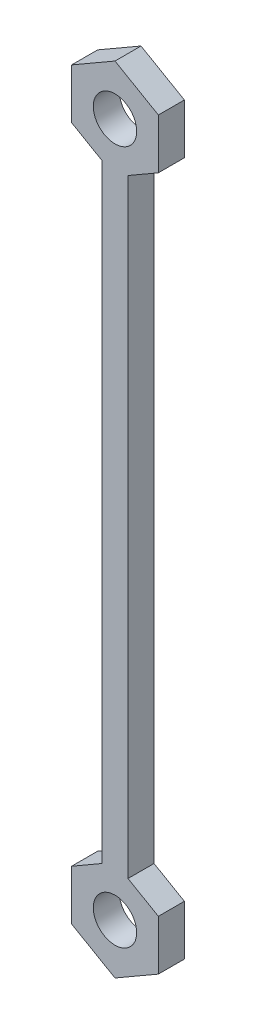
ISO-10303-21;
HEADER;
FILE_DESCRIPTION(('STEP AP214'),'2;1');
FILE_NAME('part.step','',(''),(''),'','','');
FILE_SCHEMA(('AUTOMOTIVE_DESIGN { 1 0 10303 214 1 1 1 1 }'));
ENDSEC;
DATA;
#1=APPLICATION_CONTEXT('core data for automotive mechanical design processes');
#2=APPLICATION_PROTOCOL_DEFINITION('international standard','automotive_design',2000,#1);
#3=PRODUCT_CONTEXT('',#1,'mechanical');
#4=PRODUCT('Part','Part','',(#3));
#5=PRODUCT_RELATED_PRODUCT_CATEGORY('part','',(#4));
#6=PRODUCT_DEFINITION_FORMATION('','',#4);
#7=PRODUCT_DEFINITION_CONTEXT('part definition',#1,'design');
#8=PRODUCT_DEFINITION('design','',#6,#7);
#9=PRODUCT_DEFINITION_SHAPE('','',#8);
#10=(LENGTH_UNIT() NAMED_UNIT(*) SI_UNIT(.MILLI.,.METRE.));
#11=(NAMED_UNIT(*) PLANE_ANGLE_UNIT() SI_UNIT($,.RADIAN.));
#12=(NAMED_UNIT(*) SI_UNIT($,.STERADIAN.) SOLID_ANGLE_UNIT());
#13=UNCERTAINTY_MEASURE_WITH_UNIT(LENGTH_MEASURE(1.E-05),#10,'distance_accuracy_value','');
#14=(GEOMETRIC_REPRESENTATION_CONTEXT(3) GLOBAL_UNCERTAINTY_ASSIGNED_CONTEXT((#13)) GLOBAL_UNIT_ASSIGNED_CONTEXT((#10,
#11,#12)) REPRESENTATION_CONTEXT('',''));
#15=CARTESIAN_POINT('',(0.,0.,0.));
#16=DIRECTION('',(0.,0.,1.));
#17=DIRECTION('',(1.,0.,0.));
#18=AXIS2_PLACEMENT_3D('',#15,#16,#17);
#19=CARTESIAN_POINT('',(1.5,0.,1.5));
#20=DIRECTION('',(1.,0.,0.));
#21=DIRECTION('',(0.,0.,-1.));
#22=AXIS2_PLACEMENT_3D('',#19,#20,#21);
#23=PLANE('',#22);
#24=DIRECTION('',(0.,-1.,0.));
#25=VECTOR('',#24,1.);
#26=CARTESIAN_POINT('',(1.5,0.,-1.5));
#27=LINE('',#26,#25);
#28=CARTESIAN_POINT('',(1.5,35.0925227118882,-1.5));
#29=VERTEX_POINT('',#28);
#30=CARTESIAN_POINT('',(1.5,-35.0925227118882,-1.5));
#31=VERTEX_POINT('',#30);
#32=EDGE_CURVE('E176',#29,#31,#27,.T.);
#33=ORIENTED_EDGE('',*,*,#32,.F.);
#34=DIRECTION('',(0.,0.,-1.));
#35=VECTOR('',#34,1.);
#36=CARTESIAN_POINT('',(1.5,35.0925227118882,1.5));
#37=LINE('',#36,#35);
#38=CARTESIAN_POINT('',(1.5,35.0925227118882,1.5));
#39=VERTEX_POINT('',#38);
#40=EDGE_CURVE('E11',#39,#29,#37,.T.);
#41=ORIENTED_EDGE('',*,*,#40,.F.);
#42=DIRECTION('',(0.,-1.,0.));
#43=VECTOR('',#42,1.);
#44=CARTESIAN_POINT('',(1.5,0.,1.5));
#45=LINE('',#44,#43);
#46=CARTESIAN_POINT('',(1.5,-35.0925227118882,1.5));
#47=VERTEX_POINT('',#46);
#48=EDGE_CURVE('E254',#39,#47,#45,.T.);
#49=ORIENTED_EDGE('',*,*,#48,.T.);
#50=DIRECTION('',(0.,0.,-1.));
#51=VECTOR('',#50,1.);
#52=CARTESIAN_POINT('',(1.5,-35.0925227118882,1.5));
#53=LINE('',#52,#51);
#54=EDGE_CURVE('E109',#47,#31,#53,.T.);
#55=ORIENTED_EDGE('',*,*,#54,.T.);
#56=EDGE_LOOP('',(#33,#41,#49,#55));
#57=FACE_BOUND('',#56,.T.);
#58=ADVANCED_FACE('F40',(#57),#23,.T.);
#59=CARTESIAN_POINT('',(-14.8205080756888,25.6698729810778,1.5));
#60=DIRECTION('',(0.499999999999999,-0.866025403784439,0.));
#61=DIRECTION('',(0.866025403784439,0.499999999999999,0.));
#62=AXIS2_PLACEMENT_3D('',#59,#60,#61);
#63=PLANE('',#62);
#64=DIRECTION('',(-0.866025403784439,-0.499999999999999,0.));
#65=VECTOR('',#64,1.);
#66=CARTESIAN_POINT('',(-14.8205080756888,25.6698729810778,-1.5));
#67=LINE('',#66,#65);
#68=CARTESIAN_POINT('',(5.,37.1132486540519,-1.5));
#69=VERTEX_POINT('',#68);
#70=EDGE_CURVE('E179',#69,#29,#67,.T.);
#71=ORIENTED_EDGE('',*,*,#70,.F.);
#72=DIRECTION('',(0.,0.,-1.));
#73=VECTOR('',#72,1.);
#74=CARTESIAN_POINT('',(5.,37.1132486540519,1.5));
#75=LINE('',#74,#73);
#76=CARTESIAN_POINT('',(5.,37.1132486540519,1.5));
#77=VERTEX_POINT('',#76);
#78=EDGE_CURVE('E49',#77,#69,#75,.T.);
#79=ORIENTED_EDGE('',*,*,#78,.F.);
#80=DIRECTION('',(-0.866025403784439,-0.499999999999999,0.));
#81=VECTOR('',#80,1.);
#82=CARTESIAN_POINT('',(-14.8205080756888,25.6698729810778,1.5));
#83=LINE('',#82,#81);
#84=EDGE_CURVE('E252',#77,#39,#83,.T.);
#85=ORIENTED_EDGE('',*,*,#84,.T.);
#86=ORIENTED_EDGE('',*,*,#40,.T.);
#87=EDGE_LOOP('',(#71,#79,#85,#86));
#88=FACE_BOUND('',#87,.T.);
#89=ADVANCED_FACE('F251',(#88),#63,.T.);
#90=CARTESIAN_POINT('',(4.99999999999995,0.,1.5));
#91=DIRECTION('',(-1.,0.,0.));
#92=DIRECTION('',(0.,-1.,0.));
#93=AXIS2_PLACEMENT_3D('',#90,#91,#92);
#94=PLANE('',#93);
#95=DIRECTION('',(0.,1.,0.));
#96=VECTOR('',#95,1.);
#97=CARTESIAN_POINT('',(4.99999999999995,0.,-1.5));
#98=LINE('',#97,#96);
#99=CARTESIAN_POINT('',(5.00000000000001,42.8867513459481,-1.5));
#100=VERTEX_POINT('',#99);
#101=EDGE_CURVE('E182',#69,#100,#98,.T.);
#102=ORIENTED_EDGE('',*,*,#101,.T.);
#103=DIRECTION('',(0.,0.,-1.));
#104=VECTOR('',#103,1.);
#105=CARTESIAN_POINT('',(5.00000000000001,42.8867513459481,1.5));
#106=LINE('',#105,#104);
#107=CARTESIAN_POINT('',(5.00000000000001,42.8867513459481,1.5));
#108=VERTEX_POINT('',#107);
#109=EDGE_CURVE('E236',#108,#100,#106,.T.);
#110=ORIENTED_EDGE('',*,*,#109,.F.);
#111=DIRECTION('',(0.,1.,0.));
#112=VECTOR('',#111,1.);
#113=CARTESIAN_POINT('',(4.99999999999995,0.,1.5));
#114=LINE('',#113,#112);
#115=EDGE_CURVE('E244',#77,#108,#114,.T.);
#116=ORIENTED_EDGE('',*,*,#115,.F.);
#117=ORIENTED_EDGE('',*,*,#78,.T.);
#118=EDGE_LOOP('',(#102,#110,#116,#117));
#119=FACE_BOUND('',#118,.T.);
#120=ADVANCED_FACE('F241',(#119),#94,.F.);
#121=CARTESIAN_POINT('',(19.8205080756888,34.3301270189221,1.5));
#122=DIRECTION('',(-0.500000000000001,-0.866025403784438,0.));
#123=DIRECTION('',(0.866025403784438,-0.500000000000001,0.));
#124=AXIS2_PLACEMENT_3D('',#121,#122,#123);
#125=PLANE('',#124);
#126=DIRECTION('',(-0.866025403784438,0.500000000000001,0.));
#127=VECTOR('',#126,1.);
#128=CARTESIAN_POINT('',(19.8205080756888,34.3301270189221,-1.5));
#129=LINE('',#128,#127);
#130=CARTESIAN_POINT('',(0.,45.7735026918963,-1.5));
#131=VERTEX_POINT('',#130);
#132=EDGE_CURVE('E185',#100,#131,#129,.T.);
#133=ORIENTED_EDGE('',*,*,#132,.T.);
#134=DIRECTION('',(0.,0.,-1.));
#135=VECTOR('',#134,1.);
#136=CARTESIAN_POINT('',(0.,45.7735026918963,1.5));
#137=LINE('',#136,#135);
#138=CARTESIAN_POINT('',(0.,45.7735026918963,1.5));
#139=VERTEX_POINT('',#138);
#140=EDGE_CURVE('E233',#139,#131,#137,.T.);
#141=ORIENTED_EDGE('',*,*,#140,.F.);
#142=DIRECTION('',(-0.866025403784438,0.500000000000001,0.));
#143=VECTOR('',#142,1.);
#144=CARTESIAN_POINT('',(19.8205080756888,34.3301270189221,1.5));
#145=LINE('',#144,#143);
#146=EDGE_CURVE('E263',#108,#139,#145,.T.);
#147=ORIENTED_EDGE('',*,*,#146,.F.);
#148=ORIENTED_EDGE('',*,*,#109,.T.);
#149=EDGE_LOOP('',(#133,#141,#147,#148));
#150=FACE_BOUND('',#149,.T.);
#151=ADVANCED_FACE('F306',(#150),#125,.F.);
#152=CARTESIAN_POINT('',(-19.8205080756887,34.3301270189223,1.5));
#153=DIRECTION('',(0.499999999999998,-0.86602540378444,0.));
#154=DIRECTION('',(0.86602540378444,0.499999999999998,0.));
#155=AXIS2_PLACEMENT_3D('',#152,#153,#154);
#156=PLANE('',#155);
#157=DIRECTION('',(-0.86602540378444,-0.499999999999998,0.));
#158=VECTOR('',#157,1.);
#159=CARTESIAN_POINT('',(-19.8205080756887,34.3301270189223,-1.5));
#160=LINE('',#159,#158);
#161=CARTESIAN_POINT('',(-4.99999999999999,42.8867513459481,-1.5));
#162=VERTEX_POINT('',#161);
#163=EDGE_CURVE('E188',#131,#162,#160,.T.);
#164=ORIENTED_EDGE('',*,*,#163,.T.);
#165=DIRECTION('',(0.,0.,-1.));
#166=VECTOR('',#165,1.);
#167=CARTESIAN_POINT('',(-4.99999999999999,42.8867513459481,1.5));
#168=LINE('',#167,#166);
#169=CARTESIAN_POINT('',(-4.99999999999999,42.8867513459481,1.5));
#170=VERTEX_POINT('',#169);
#171=EDGE_CURVE('E230',#170,#162,#168,.T.);
#172=ORIENTED_EDGE('',*,*,#171,.F.);
#173=DIRECTION('',(-0.86602540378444,-0.499999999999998,0.));
#174=VECTOR('',#173,1.);
#175=CARTESIAN_POINT('',(-19.8205080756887,34.3301270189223,1.5));
#176=LINE('',#175,#174);
#177=EDGE_CURVE('E266',#139,#170,#176,.T.);
#178=ORIENTED_EDGE('',*,*,#177,.F.);
#179=ORIENTED_EDGE('',*,*,#140,.T.);
#180=EDGE_LOOP('',(#164,#172,#178,#179));
#181=FACE_BOUND('',#180,.T.);
#182=ADVANCED_FACE('F303',(#181),#156,.F.);
#183=CARTESIAN_POINT('',(-5.00000000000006,0.,1.5));
#184=DIRECTION('',(1.,0.,0.));
#185=DIRECTION('',(0.,1.,0.));
#186=AXIS2_PLACEMENT_3D('',#183,#184,#185);
#187=PLANE('',#186);
#188=DIRECTION('',(0.,-1.,0.));
#189=VECTOR('',#188,1.);
#190=CARTESIAN_POINT('',(-5.00000000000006,0.,-1.5));
#191=LINE('',#190,#189);
#192=CARTESIAN_POINT('',(-5.,37.1132486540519,-1.5));
#193=VERTEX_POINT('',#192);
#194=EDGE_CURVE('E191',#162,#193,#191,.T.);
#195=ORIENTED_EDGE('',*,*,#194,.T.);
#196=DIRECTION('',(0.,0.,-1.));
#197=VECTOR('',#196,1.);
#198=CARTESIAN_POINT('',(-5.,37.1132486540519,1.5));
#199=LINE('',#198,#197);
#200=CARTESIAN_POINT('',(-5.,37.1132486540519,1.5));
#201=VERTEX_POINT('',#200);
#202=EDGE_CURVE('E227',#201,#193,#199,.T.);
#203=ORIENTED_EDGE('',*,*,#202,.F.);
#204=DIRECTION('',(0.,-1.,0.));
#205=VECTOR('',#204,1.);
#206=CARTESIAN_POINT('',(-5.00000000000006,0.,1.5));
#207=LINE('',#206,#205);
#208=EDGE_CURVE('E269',#170,#201,#207,.T.);
#209=ORIENTED_EDGE('',*,*,#208,.F.);
#210=ORIENTED_EDGE('',*,*,#171,.T.);
#211=EDGE_LOOP('',(#195,#203,#209,#210));
#212=FACE_BOUND('',#211,.T.);
#213=ADVANCED_FACE('F300',(#212),#187,.F.);
#214=CARTESIAN_POINT('',(14.8205080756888,25.6698729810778,1.5));
#215=DIRECTION('',(0.500000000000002,0.866025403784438,0.));
#216=DIRECTION('',(-0.866025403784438,0.500000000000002,0.));
#217=AXIS2_PLACEMENT_3D('',#214,#215,#216);
#218=PLANE('',#217);
#219=DIRECTION('',(0.866025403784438,-0.500000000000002,0.));
#220=VECTOR('',#219,1.);
#221=CARTESIAN_POINT('',(14.8205080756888,25.6698729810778,-1.5));
#222=LINE('',#221,#220);
#223=CARTESIAN_POINT('',(-1.5,35.0925227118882,-1.5));
#224=VERTEX_POINT('',#223);
#225=EDGE_CURVE('E194',#193,#224,#222,.T.);
#226=ORIENTED_EDGE('',*,*,#225,.T.);
#227=DIRECTION('',(0.,0.,-1.));
#228=VECTOR('',#227,1.);
#229=CARTESIAN_POINT('',(-1.5,35.0925227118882,1.5));
#230=LINE('',#229,#228);
#231=CARTESIAN_POINT('',(-1.5,35.0925227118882,1.5));
#232=VERTEX_POINT('',#231);
#233=EDGE_CURVE('E224',#232,#224,#230,.T.);
#234=ORIENTED_EDGE('',*,*,#233,.F.);
#235=DIRECTION('',(0.866025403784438,-0.500000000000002,0.));
#236=VECTOR('',#235,1.);
#237=CARTESIAN_POINT('',(14.8205080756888,25.6698729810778,1.5));
#238=LINE('',#237,#236);
#239=EDGE_CURVE('E272',#201,#232,#238,.T.);
#240=ORIENTED_EDGE('',*,*,#239,.F.);
#241=ORIENTED_EDGE('',*,*,#202,.T.);
#242=EDGE_LOOP('',(#226,#234,#240,#241));
#243=FACE_BOUND('',#242,.T.);
#244=ADVANCED_FACE('F298',(#243),#218,.F.);
#245=CARTESIAN_POINT('',(-1.5,0.,1.5));
#246=DIRECTION('',(1.,0.,0.));
#247=DIRECTION('',(0.,0.,-1.));
#248=AXIS2_PLACEMENT_3D('',#245,#246,#247);
#249=PLANE('',#248);
#250=DIRECTION('',(0.,-1.,0.));
#251=VECTOR('',#250,1.);
#252=CARTESIAN_POINT('',(-1.5,0.,-1.5));
#253=LINE('',#252,#251);
#254=CARTESIAN_POINT('',(-1.5,-35.0925227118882,-1.5));
#255=VERTEX_POINT('',#254);
#256=EDGE_CURVE('E197',#224,#255,#253,.T.);
#257=ORIENTED_EDGE('',*,*,#256,.T.);
#258=DIRECTION('',(0.,0.,-1.));
#259=VECTOR('',#258,1.);
#260=CARTESIAN_POINT('',(-1.5,-35.0925227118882,1.5));
#261=LINE('',#260,#259);
#262=CARTESIAN_POINT('',(-1.5,-35.0925227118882,1.5));
#263=VERTEX_POINT('',#262);
#264=EDGE_CURVE('E222',#263,#255,#261,.T.);
#265=ORIENTED_EDGE('',*,*,#264,.F.);
#266=DIRECTION('',(0.,-1.,0.));
#267=VECTOR('',#266,1.);
#268=CARTESIAN_POINT('',(-1.5,0.,1.5));
#269=LINE('',#268,#267);
#270=EDGE_CURVE('E275',#232,#263,#269,.T.);
#271=ORIENTED_EDGE('',*,*,#270,.F.);
#272=ORIENTED_EDGE('',*,*,#233,.T.);
#273=EDGE_LOOP('',(#257,#265,#271,#272));
#274=FACE_BOUND('',#273,.T.);
#275=ADVANCED_FACE('F294',(#274),#249,.F.);
#276=CARTESIAN_POINT('',(14.8205080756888,-25.6698729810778,1.5));
#277=DIRECTION('',(-0.500000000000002,0.866025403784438,0.));
#278=DIRECTION('',(-0.866025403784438,-0.500000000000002,0.));
#279=AXIS2_PLACEMENT_3D('',#276,#277,#278);
#280=PLANE('',#279);
#281=DIRECTION('',(0.866025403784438,0.500000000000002,0.));
#282=VECTOR('',#281,1.);
#283=CARTESIAN_POINT('',(14.8205080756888,-25.6698729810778,-1.5));
#284=LINE('',#283,#282);
#285=CARTESIAN_POINT('',(-5.,-37.1132486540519,-1.5));
#286=VERTEX_POINT('',#285);
#287=EDGE_CURVE('E200',#286,#255,#284,.T.);
#288=ORIENTED_EDGE('',*,*,#287,.F.);
#289=DIRECTION('',(0.,0.,-1.));
#290=VECTOR('',#289,1.);
#291=CARTESIAN_POINT('',(-5.,-37.1132486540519,1.5));
#292=LINE('',#291,#290);
#293=CARTESIAN_POINT('',(-5.,-37.1132486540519,1.5));
#294=VERTEX_POINT('',#293);
#295=EDGE_CURVE('E220',#294,#286,#292,.T.);
#296=ORIENTED_EDGE('',*,*,#295,.F.);
#297=DIRECTION('',(0.866025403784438,0.500000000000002,0.));
#298=VECTOR('',#297,1.);
#299=CARTESIAN_POINT('',(14.8205080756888,-25.6698729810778,1.5));
#300=LINE('',#299,#298);
#301=EDGE_CURVE('E277',#294,#263,#300,.T.);
#302=ORIENTED_EDGE('',*,*,#301,.T.);
#303=ORIENTED_EDGE('',*,*,#264,.T.);
#304=EDGE_LOOP('',(#288,#296,#302,#303));
#305=FACE_BOUND('',#304,.T.);
#306=ADVANCED_FACE('F291',(#305),#280,.T.);
#307=CARTESIAN_POINT('',(-5.00000000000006,0.,1.5));
#308=DIRECTION('',(-1.,0.,0.));
#309=DIRECTION('',(0.,-1.,0.));
#310=AXIS2_PLACEMENT_3D('',#307,#308,#309);
#311=PLANE('',#310);
#312=DIRECTION('',(0.,1.,0.));
#313=VECTOR('',#312,1.);
#314=CARTESIAN_POINT('',(-5.00000000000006,0.,-1.5));
#315=LINE('',#314,#313);
#316=CARTESIAN_POINT('',(-4.99999999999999,-42.8867513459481,-1.5));
#317=VERTEX_POINT('',#316);
#318=EDGE_CURVE('E203',#317,#286,#315,.T.);
#319=ORIENTED_EDGE('',*,*,#318,.F.);
#320=DIRECTION('',(0.,0.,-1.));
#321=VECTOR('',#320,1.);
#322=CARTESIAN_POINT('',(-4.99999999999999,-42.8867513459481,1.5));
#323=LINE('',#322,#321);
#324=CARTESIAN_POINT('',(-4.99999999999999,-42.8867513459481,1.5));
#325=VERTEX_POINT('',#324);
#326=EDGE_CURVE('E218',#325,#317,#323,.T.);
#327=ORIENTED_EDGE('',*,*,#326,.F.);
#328=DIRECTION('',(0.,1.,0.));
#329=VECTOR('',#328,1.);
#330=CARTESIAN_POINT('',(-5.00000000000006,0.,1.5));
#331=LINE('',#330,#329);
#332=EDGE_CURVE('E280',#325,#294,#331,.T.);
#333=ORIENTED_EDGE('',*,*,#332,.T.);
#334=ORIENTED_EDGE('',*,*,#295,.T.);
#335=EDGE_LOOP('',(#319,#327,#333,#334));
#336=FACE_BOUND('',#335,.T.);
#337=ADVANCED_FACE('F288',(#336),#311,.T.);
#338=CARTESIAN_POINT('',(-19.8205080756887,-34.3301270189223,1.5));
#339=DIRECTION('',(-0.499999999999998,-0.86602540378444,0.));
#340=DIRECTION('',(0.86602540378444,-0.499999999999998,0.));
#341=AXIS2_PLACEMENT_3D('',#338,#339,#340);
#342=PLANE('',#341);
#343=DIRECTION('',(-0.86602540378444,0.499999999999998,0.));
#344=VECTOR('',#343,1.);
#345=CARTESIAN_POINT('',(-19.8205080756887,-34.3301270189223,-1.5));
#346=LINE('',#345,#344);
#347=CARTESIAN_POINT('',(0.,-45.7735026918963,-1.5));
#348=VERTEX_POINT('',#347);
#349=EDGE_CURVE('E206',#348,#317,#346,.T.);
#350=ORIENTED_EDGE('',*,*,#349,.F.);
#351=DIRECTION('',(0.,0.,-1.));
#352=VECTOR('',#351,1.);
#353=CARTESIAN_POINT('',(0.,-45.7735026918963,1.5));
#354=LINE('',#353,#352);
#355=CARTESIAN_POINT('',(0.,-45.7735026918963,1.5));
#356=VERTEX_POINT('',#355);
#357=EDGE_CURVE('E156',#356,#348,#354,.T.);
#358=ORIENTED_EDGE('',*,*,#357,.F.);
#359=DIRECTION('',(-0.86602540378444,0.499999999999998,0.));
#360=VECTOR('',#359,1.);
#361=CARTESIAN_POINT('',(-19.8205080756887,-34.3301270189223,1.5));
#362=LINE('',#361,#360);
#363=EDGE_CURVE('E163',#356,#325,#362,.T.);
#364=ORIENTED_EDGE('',*,*,#363,.T.);
#365=ORIENTED_EDGE('',*,*,#326,.T.);
#366=EDGE_LOOP('',(#350,#358,#364,#365));
#367=FACE_BOUND('',#366,.T.);
#368=ADVANCED_FACE('F284',(#367),#342,.T.);
#369=CARTESIAN_POINT('',(19.8205080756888,-34.3301270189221,1.5));
#370=DIRECTION('',(0.500000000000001,-0.866025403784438,0.));
#371=DIRECTION('',(0.866025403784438,0.500000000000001,0.));
#372=AXIS2_PLACEMENT_3D('',#369,#370,#371);
#373=PLANE('',#372);
#374=DIRECTION('',(-0.866025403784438,-0.500000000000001,0.));
#375=VECTOR('',#374,1.);
#376=CARTESIAN_POINT('',(19.8205080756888,-34.3301270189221,-1.5));
#377=LINE('',#376,#375);
#378=CARTESIAN_POINT('',(5.00000000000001,-42.8867513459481,-1.5));
#379=VERTEX_POINT('',#378);
#380=EDGE_CURVE('E151',#379,#348,#377,.T.);
#381=ORIENTED_EDGE('',*,*,#380,.F.);
#382=DIRECTION('',(0.,0.,-1.));
#383=VECTOR('',#382,1.);
#384=CARTESIAN_POINT('',(5.00000000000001,-42.8867513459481,1.5));
#385=LINE('',#384,#383);
#386=CARTESIAN_POINT('',(5.00000000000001,-42.8867513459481,1.5));
#387=VERTEX_POINT('',#386);
#388=EDGE_CURVE('E146',#387,#379,#385,.T.);
#389=ORIENTED_EDGE('',*,*,#388,.F.);
#390=DIRECTION('',(-0.866025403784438,-0.500000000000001,0.));
#391=VECTOR('',#390,1.);
#392=CARTESIAN_POINT('',(19.8205080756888,-34.3301270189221,1.5));
#393=LINE('',#392,#391);
#394=EDGE_CURVE('E149',#387,#356,#393,.T.);
#395=ORIENTED_EDGE('',*,*,#394,.T.);
#396=ORIENTED_EDGE('',*,*,#357,.T.);
#397=EDGE_LOOP('',(#381,#389,#395,#396));
#398=FACE_BOUND('',#397,.T.);
#399=ADVANCED_FACE('F148',(#398),#373,.T.);
#400=CARTESIAN_POINT('',(4.99999999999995,0.,1.5));
#401=DIRECTION('',(1.,0.,0.));
#402=DIRECTION('',(0.,1.,0.));
#403=AXIS2_PLACEMENT_3D('',#400,#401,#402);
#404=PLANE('',#403);
#405=DIRECTION('',(0.,-1.,0.));
#406=VECTOR('',#405,1.);
#407=CARTESIAN_POINT('',(4.99999999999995,0.,-1.5));
#408=LINE('',#407,#406);
#409=CARTESIAN_POINT('',(5.,-37.1132486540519,-1.5));
#410=VERTEX_POINT('',#409);
#411=EDGE_CURVE('E210',#410,#379,#408,.T.);
#412=ORIENTED_EDGE('',*,*,#411,.F.);
#413=DIRECTION('',(0.,0.,-1.));
#414=VECTOR('',#413,1.);
#415=CARTESIAN_POINT('',(5.,-37.1132486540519,1.5));
#416=LINE('',#415,#414);
#417=CARTESIAN_POINT('',(5.,-37.1132486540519,1.5));
#418=VERTEX_POINT('',#417);
#419=EDGE_CURVE('E102',#418,#410,#416,.T.);
#420=ORIENTED_EDGE('',*,*,#419,.F.);
#421=DIRECTION('',(0.,-1.,0.));
#422=VECTOR('',#421,1.);
#423=CARTESIAN_POINT('',(4.99999999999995,0.,1.5));
#424=LINE('',#423,#422);
#425=EDGE_CURVE('E160',#418,#387,#424,.T.);
#426=ORIENTED_EDGE('',*,*,#425,.T.);
#427=ORIENTED_EDGE('',*,*,#388,.T.);
#428=EDGE_LOOP('',(#412,#420,#426,#427));
#429=FACE_BOUND('',#428,.T.);
#430=ADVANCED_FACE('F165',(#429),#404,.T.);
#431=CARTESIAN_POINT('',(0.,40.,1.5));
#432=DIRECTION('',(0.,0.,-1.));
#433=DIRECTION('',(-1.,0.,0.));
#434=AXIS2_PLACEMENT_3D('',#431,#432,#433);
#435=CYLINDRICAL_SURFACE('',#434,2.5);
#436=CARTESIAN_POINT('',(0.,40.,1.5));
#437=DIRECTION('',(0.,0.,1.));
#438=DIRECTION('',(1.,0.,0.));
#439=AXIS2_PLACEMENT_3D('',#436,#437,#438);
#440=CIRCLE('',#439,2.5);
#441=CARTESIAN_POINT('',(2.50000000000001,40.,1.5));
#442=VERTEX_POINT('',#441);
#443=EDGE_CURVE('E255',#442,#442,#440,.T.);
#444=ORIENTED_EDGE('',*,*,#443,.T.);
#445=EDGE_LOOP('',(#444));
#446=FACE_BOUND('',#445,.T.);
#447=CARTESIAN_POINT('',(0.,40.,-1.5));
#448=DIRECTION('',(0.,0.,1.));
#449=DIRECTION('',(1.,0.,0.));
#450=AXIS2_PLACEMENT_3D('',#447,#448,#449);
#451=CIRCLE('',#450,2.5);
#452=CARTESIAN_POINT('',(2.50000000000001,40.,-1.5));
#453=VERTEX_POINT('',#452);
#454=EDGE_CURVE('E173',#453,#453,#451,.T.);
#455=ORIENTED_EDGE('',*,*,#454,.F.);
#456=EDGE_LOOP('',(#455));
#457=FACE_BOUND('',#456,.T.);
#458=ADVANCED_FACE('F321',(#446,#457),#435,.F.);
#459=CARTESIAN_POINT('',(0.,-40.,1.5));
#460=DIRECTION('',(0.,0.,-1.));
#461=DIRECTION('',(-1.,0.,0.));
#462=AXIS2_PLACEMENT_3D('',#459,#460,#461);
#463=CYLINDRICAL_SURFACE('',#462,2.5);
#464=CARTESIAN_POINT('',(0.,-40.,1.5));
#465=DIRECTION('',(0.,0.,1.));
#466=DIRECTION('',(1.,0.,0.));
#467=AXIS2_PLACEMENT_3D('',#464,#465,#466);
#468=CIRCLE('',#467,2.5);
#469=CARTESIAN_POINT('',(2.50000000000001,-40.,1.5));
#470=VERTEX_POINT('',#469);
#471=EDGE_CURVE('E214',#470,#470,#468,.T.);
#472=ORIENTED_EDGE('',*,*,#471,.T.);
#473=EDGE_LOOP('',(#472));
#474=FACE_BOUND('',#473,.T.);
#475=CARTESIAN_POINT('',(0.,-40.,-1.5));
#476=DIRECTION('',(0.,0.,1.));
#477=DIRECTION('',(1.,0.,0.));
#478=AXIS2_PLACEMENT_3D('',#475,#476,#477);
#479=CIRCLE('',#478,2.5);
#480=CARTESIAN_POINT('',(2.50000000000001,-40.,-1.5));
#481=VERTEX_POINT('',#480);
#482=EDGE_CURVE('E170',#481,#481,#479,.T.);
#483=ORIENTED_EDGE('',*,*,#482,.F.);
#484=EDGE_LOOP('',(#483));
#485=FACE_BOUND('',#484,.T.);
#486=ADVANCED_FACE('F42',(#474,#485),#463,.F.);
#487=CARTESIAN_POINT('',(-14.8205080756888,-25.6698729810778,1.5));
#488=DIRECTION('',(-0.499999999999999,-0.866025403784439,0.));
#489=DIRECTION('',(0.866025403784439,-0.499999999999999,0.));
#490=AXIS2_PLACEMENT_3D('',#487,#488,#489);
#491=PLANE('',#490);
#492=DIRECTION('',(-0.866025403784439,0.499999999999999,0.));
#493=VECTOR('',#492,1.);
#494=CARTESIAN_POINT('',(-14.8205080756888,-25.6698729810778,-1.5));
#495=LINE('',#494,#493);
#496=EDGE_CURVE('E212',#410,#31,#495,.T.);
#497=ORIENTED_EDGE('',*,*,#496,.T.);
#498=ORIENTED_EDGE('',*,*,#54,.F.);
#499=DIRECTION('',(-0.866025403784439,0.499999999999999,0.));
#500=VECTOR('',#499,1.);
#501=CARTESIAN_POINT('',(-14.8205080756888,-25.6698729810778,1.5));
#502=LINE('',#501,#500);
#503=EDGE_CURVE('E57',#418,#47,#502,.T.);
#504=ORIENTED_EDGE('',*,*,#503,.F.);
#505=ORIENTED_EDGE('',*,*,#419,.T.);
#506=EDGE_LOOP('',(#497,#498,#504,#505));
#507=FACE_BOUND('',#506,.T.);
#508=ADVANCED_FACE('F253',(#507),#491,.F.);
#509=CARTESIAN_POINT('',(0.,0.,1.5));
#510=DIRECTION('',(0.,0.,1.));
#511=DIRECTION('',(1.,0.,0.));
#512=AXIS2_PLACEMENT_3D('',#509,#510,#511);
#513=PLANE('',#512);
#514=ORIENTED_EDGE('',*,*,#471,.F.);
#515=EDGE_LOOP('',(#514));
#516=FACE_BOUND('',#515,.T.);
#517=ORIENTED_EDGE('',*,*,#443,.F.);
#518=EDGE_LOOP('',(#517));
#519=FACE_BOUND('',#518,.T.);
#520=ORIENTED_EDGE('',*,*,#48,.F.);
#521=ORIENTED_EDGE('',*,*,#84,.F.);
#522=ORIENTED_EDGE('',*,*,#115,.T.);
#523=ORIENTED_EDGE('',*,*,#146,.T.);
#524=ORIENTED_EDGE('',*,*,#177,.T.);
#525=ORIENTED_EDGE('',*,*,#208,.T.);
#526=ORIENTED_EDGE('',*,*,#239,.T.);
#527=ORIENTED_EDGE('',*,*,#270,.T.);
#528=ORIENTED_EDGE('',*,*,#301,.F.);
#529=ORIENTED_EDGE('',*,*,#332,.F.);
#530=ORIENTED_EDGE('',*,*,#363,.F.);
#531=ORIENTED_EDGE('',*,*,#394,.F.);
#532=ORIENTED_EDGE('',*,*,#425,.F.);
#533=ORIENTED_EDGE('',*,*,#503,.T.);
#534=EDGE_LOOP('',(#520,#521,#522,#523,#524,#525,#526,#527,#528,#529,#530,#531,#532,#533));
#535=FACE_BOUND('',#534,.T.);
#536=ADVANCED_FACE('F159',(#516,#519,#535),#513,.T.);
#537=CARTESIAN_POINT('',(0.,0.,-1.5));
#538=DIRECTION('',(0.,0.,1.));
#539=DIRECTION('',(1.,0.,0.));
#540=AXIS2_PLACEMENT_3D('',#537,#538,#539);
#541=PLANE('',#540);
#542=ORIENTED_EDGE('',*,*,#482,.T.);
#543=EDGE_LOOP('',(#542));
#544=FACE_BOUND('',#543,.T.);
#545=ORIENTED_EDGE('',*,*,#454,.T.);
#546=EDGE_LOOP('',(#545));
#547=FACE_BOUND('',#546,.T.);
#548=ORIENTED_EDGE('',*,*,#32,.T.);
#549=ORIENTED_EDGE('',*,*,#496,.F.);
#550=ORIENTED_EDGE('',*,*,#411,.T.);
#551=ORIENTED_EDGE('',*,*,#380,.T.);
#552=ORIENTED_EDGE('',*,*,#349,.T.);
#553=ORIENTED_EDGE('',*,*,#318,.T.);
#554=ORIENTED_EDGE('',*,*,#287,.T.);
#555=ORIENTED_EDGE('',*,*,#256,.F.);
#556=ORIENTED_EDGE('',*,*,#225,.F.);
#557=ORIENTED_EDGE('',*,*,#194,.F.);
#558=ORIENTED_EDGE('',*,*,#163,.F.);
#559=ORIENTED_EDGE('',*,*,#132,.F.);
#560=ORIENTED_EDGE('',*,*,#101,.F.);
#561=ORIENTED_EDGE('',*,*,#70,.T.);
#562=EDGE_LOOP('',(#548,#549,#550,#551,#552,#553,#554,#555,#556,#557,#558,#559,#560,#561));
#563=FACE_BOUND('',#562,.T.);
#564=ADVANCED_FACE('F250',(#544,#547,#563),#541,.F.);
#565=CLOSED_SHELL('',(#58,#89,#120,#151,#182,#213,#244,#275,#306,#337,#368,#399,#430,#458,#486,
#508,#536,#564));
#566=MANIFOLD_SOLID_BREP('B2',#565);
#567=ADVANCED_BREP_SHAPE_REPRESENTATION('',(#18,#566),#14);
#568=SHAPE_DEFINITION_REPRESENTATION(#9,#567);
ENDSEC;
END-ISO-10303-21;
